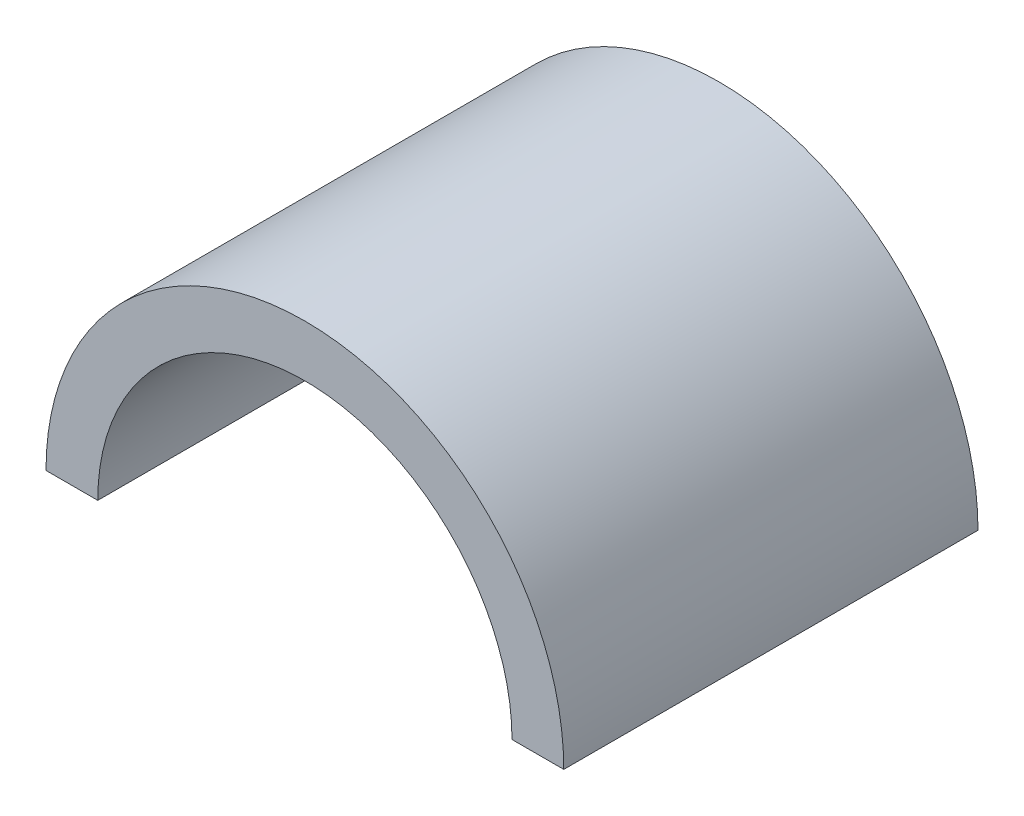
from build123d import *

# Parameters (mm, degrees)
EXTRUDE1_DEPTH = 40


with BuildPart() as part:
    # Sketch1 → Extrude1 (new, symmetric)
    with BuildSketch(Plane.XY):
        with BuildLine():
            Line((50, 0), (40, 0))
            ThreePointArc((40, 0), (0, 40), (-40, 0))
            Line((-40, 0), (-50, 0))
            ThreePointArc((-50, 0), (0, 50), (50, 0))
        make_face()
    extrude(amount=EXTRUDE1_DEPTH, both=True)


solid = part.part
